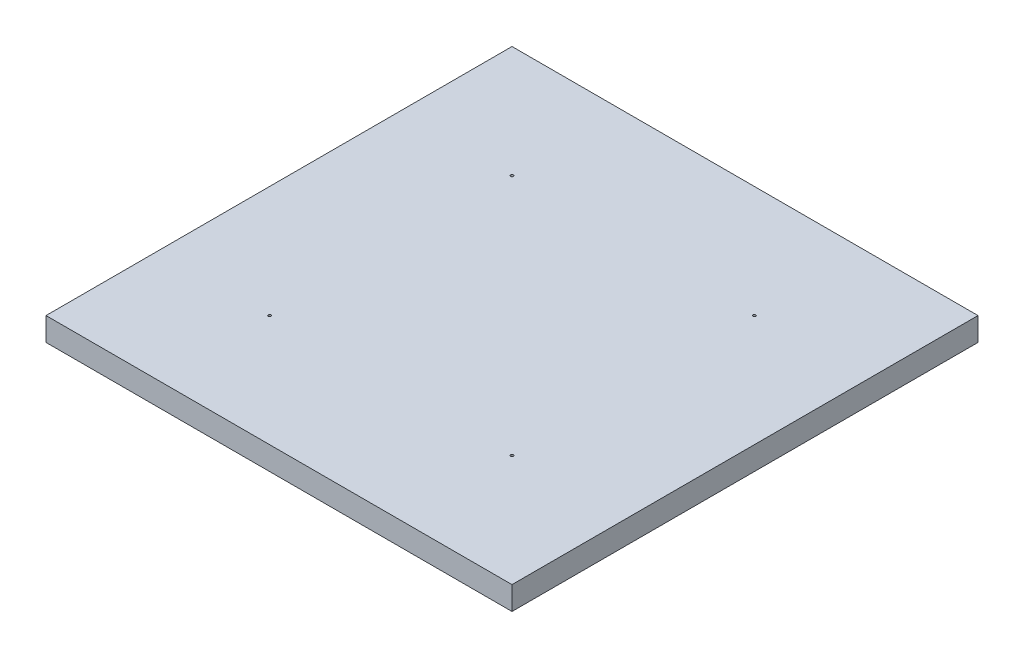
ISO-10303-21;
HEADER;
FILE_DESCRIPTION(('STEP AP214'),'2;1');
FILE_NAME('part.step','',(''),(''),'','','');
FILE_SCHEMA(('AUTOMOTIVE_DESIGN { 1 0 10303 214 1 1 1 1 }'));
ENDSEC;
DATA;
#1=APPLICATION_CONTEXT('core data for automotive mechanical design processes');
#2=APPLICATION_PROTOCOL_DEFINITION('international standard','automotive_design',2000,#1);
#3=PRODUCT_CONTEXT('',#1,'mechanical');
#4=PRODUCT('Part','Part','',(#3));
#5=PRODUCT_RELATED_PRODUCT_CATEGORY('part','',(#4));
#6=PRODUCT_DEFINITION_FORMATION('','',#4);
#7=PRODUCT_DEFINITION_CONTEXT('part definition',#1,'design');
#8=PRODUCT_DEFINITION('design','',#6,#7);
#9=PRODUCT_DEFINITION_SHAPE('','',#8);
#10=(LENGTH_UNIT() NAMED_UNIT(*) SI_UNIT(.MILLI.,.METRE.));
#11=(NAMED_UNIT(*) PLANE_ANGLE_UNIT() SI_UNIT($,.RADIAN.));
#12=(NAMED_UNIT(*) SI_UNIT($,.STERADIAN.) SOLID_ANGLE_UNIT());
#13=UNCERTAINTY_MEASURE_WITH_UNIT(LENGTH_MEASURE(1.E-05),#10,'distance_accuracy_value','');
#14=(GEOMETRIC_REPRESENTATION_CONTEXT(3) GLOBAL_UNCERTAINTY_ASSIGNED_CONTEXT((#13)) GLOBAL_UNIT_ASSIGNED_CONTEXT((#10,
#11,#12)) REPRESENTATION_CONTEXT('',''));
#15=CARTESIAN_POINT('',(0.,0.,0.));
#16=DIRECTION('',(0.,0.,1.));
#17=DIRECTION('',(1.,0.,0.));
#18=AXIS2_PLACEMENT_3D('',#15,#16,#17);
#19=CARTESIAN_POINT('',(-250.,25.,250.));
#20=DIRECTION('',(0.,-1.,0.));
#21=DIRECTION('',(0.,0.,-1.));
#22=AXIS2_PLACEMENT_3D('',#19,#20,#21);
#23=PLANE('',#22);
#24=CARTESIAN_POINT('',(-130.,25.,130.000000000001));
#25=DIRECTION('',(0.,-1.,0.));
#26=DIRECTION('',(-0.707106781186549,0.,0.707106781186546));
#27=AXIS2_PLACEMENT_3D('',#24,#25,#26);
#28=ELLIPSE('',#27,1.50763363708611,1.50000000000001);
#29=CARTESIAN_POINT('',(-131.066057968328,25.,131.066057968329));
#30=VERTEX_POINT('',#29);
#31=EDGE_CURVE('E429',#30,#30,#28,.F.);
#32=ORIENTED_EDGE('',*,*,#31,.F.);
#33=EDGE_LOOP('',(#32));
#34=FACE_BOUND('',#33,.T.);
#35=CARTESIAN_POINT('',(-130.,25.,-130.000000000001));
#36=DIRECTION('',(0.,-1.,0.));
#37=DIRECTION('',(-0.707106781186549,0.,-0.707106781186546));
#38=AXIS2_PLACEMENT_3D('',#35,#36,#37);
#39=ELLIPSE('',#38,1.50763363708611,1.50000000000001);
#40=CARTESIAN_POINT('',(-131.066057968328,25.,-131.066057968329));
#41=VERTEX_POINT('',#40);
#42=EDGE_CURVE('E408',#41,#41,#39,.T.);
#43=ORIENTED_EDGE('',*,*,#42,.T.);
#44=EDGE_LOOP('',(#43));
#45=FACE_BOUND('',#44,.T.);
#46=DIRECTION('',(0.,0.,1.));
#47=VECTOR('',#46,1.);
#48=CARTESIAN_POINT('',(-250.,25.,250.));
#49=LINE('',#48,#47);
#50=CARTESIAN_POINT('',(-250.,25.,-250.));
#51=VERTEX_POINT('',#50);
#52=CARTESIAN_POINT('',(-250.,25.,250.));
#53=VERTEX_POINT('',#52);
#54=EDGE_CURVE('E419',#51,#53,#49,.T.);
#55=ORIENTED_EDGE('',*,*,#54,.T.);
#56=DIRECTION('',(1.,0.,0.));
#57=VECTOR('',#56,1.);
#58=CARTESIAN_POINT('',(-250.,25.,250.));
#59=LINE('',#58,#57);
#60=CARTESIAN_POINT('',(250.,25.,250.));
#61=VERTEX_POINT('',#60);
#62=EDGE_CURVE('E403',#53,#61,#59,.T.);
#63=ORIENTED_EDGE('',*,*,#62,.T.);
#64=DIRECTION('',(0.,0.,-1.));
#65=VECTOR('',#64,1.);
#66=CARTESIAN_POINT('',(250.,25.,250.));
#67=LINE('',#66,#65);
#68=CARTESIAN_POINT('',(250.,25.,-250.));
#69=VERTEX_POINT('',#68);
#70=EDGE_CURVE('E370',#61,#69,#67,.T.);
#71=ORIENTED_EDGE('',*,*,#70,.T.);
#72=DIRECTION('',(-1.,0.,0.));
#73=VECTOR('',#72,1.);
#74=CARTESIAN_POINT('',(-250.,25.,-250.));
#75=LINE('',#74,#73);
#76=EDGE_CURVE('E365',#69,#51,#75,.T.);
#77=ORIENTED_EDGE('',*,*,#76,.T.);
#78=EDGE_LOOP('',(#55,#63,#71,#77));
#79=FACE_BOUND('',#78,.T.);
#80=CARTESIAN_POINT('',(130.,25.,130.000000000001));
#81=DIRECTION('',(0.,-1.,0.));
#82=DIRECTION('',(0.707106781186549,0.,0.707106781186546));
#83=AXIS2_PLACEMENT_3D('',#80,#81,#82);
#84=ELLIPSE('',#83,1.50763363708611,1.50000000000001);
#85=CARTESIAN_POINT('',(131.066057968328,25.,131.066057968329));
#86=VERTEX_POINT('',#85);
#87=EDGE_CURVE('E432',#86,#86,#84,.T.);
#88=ORIENTED_EDGE('',*,*,#87,.T.);
#89=EDGE_LOOP('',(#88));
#90=FACE_BOUND('',#89,.T.);
#91=CARTESIAN_POINT('',(130.,25.,-130.000000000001));
#92=DIRECTION('',(0.,-1.,0.));
#93=DIRECTION('',(0.707106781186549,0.,-0.707106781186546));
#94=AXIS2_PLACEMENT_3D('',#91,#92,#93);
#95=ELLIPSE('',#94,1.50763363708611,1.50000000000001);
#96=CARTESIAN_POINT('',(131.066057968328,25.,-131.066057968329));
#97=VERTEX_POINT('',#96);
#98=EDGE_CURVE('E352',#97,#97,#95,.F.);
#99=ORIENTED_EDGE('',*,*,#98,.F.);
#100=EDGE_LOOP('',(#99));
#101=FACE_BOUND('',#100,.T.);
#102=ADVANCED_FACE('F348',(#34,#45,#79,#90,#101),#23,.F.);
#103=CARTESIAN_POINT('',(-250.,25.,250.));
#104=DIRECTION('',(1.,0.,0.));
#105=DIRECTION('',(0.,0.,-1.));
#106=AXIS2_PLACEMENT_3D('',#103,#104,#105);
#107=PLANE('',#106);
#108=DIRECTION('',(0.,0.,1.));
#109=VECTOR('',#108,1.);
#110=CARTESIAN_POINT('',(-250.,0.,250.));
#111=LINE('',#110,#109);
#112=CARTESIAN_POINT('',(-250.,0.,-250.));
#113=VERTEX_POINT('',#112);
#114=CARTESIAN_POINT('',(-250.,0.,250.));
#115=VERTEX_POINT('',#114);
#116=EDGE_CURVE('E395',#113,#115,#111,.T.);
#117=ORIENTED_EDGE('',*,*,#116,.T.);
#118=DIRECTION('',(0.,-1.,0.));
#119=VECTOR('',#118,1.);
#120=CARTESIAN_POINT('',(-250.,25.,250.));
#121=LINE('',#120,#119);
#122=EDGE_CURVE('E11',#53,#115,#121,.T.);
#123=ORIENTED_EDGE('',*,*,#122,.F.);
#124=ORIENTED_EDGE('',*,*,#54,.F.);
#125=DIRECTION('',(0.,-1.,0.));
#126=VECTOR('',#125,1.);
#127=CARTESIAN_POINT('',(-250.,25.,-250.));
#128=LINE('',#127,#126);
#129=EDGE_CURVE('E407',#51,#113,#128,.T.);
#130=ORIENTED_EDGE('',*,*,#129,.T.);
#131=EDGE_LOOP('',(#117,#123,#124,#130));
#132=FACE_BOUND('',#131,.T.);
#133=ADVANCED_FACE('F350',(#132),#107,.F.);
#134=CARTESIAN_POINT('',(-250.,25.,250.));
#135=DIRECTION('',(0.,0.,-1.));
#136=DIRECTION('',(-1.,0.,0.));
#137=AXIS2_PLACEMENT_3D('',#134,#135,#136);
#138=PLANE('',#137);
#139=DIRECTION('',(1.,0.,0.));
#140=VECTOR('',#139,1.);
#141=CARTESIAN_POINT('',(-250.,0.,250.));
#142=LINE('',#141,#140);
#143=CARTESIAN_POINT('',(250.,0.,250.));
#144=VERTEX_POINT('',#143);
#145=EDGE_CURVE('E391',#115,#144,#142,.T.);
#146=ORIENTED_EDGE('',*,*,#145,.T.);
#147=DIRECTION('',(0.,-1.,0.));
#148=VECTOR('',#147,1.);
#149=CARTESIAN_POINT('',(250.,25.,250.));
#150=LINE('',#149,#148);
#151=EDGE_CURVE('E357',#61,#144,#150,.T.);
#152=ORIENTED_EDGE('',*,*,#151,.F.);
#153=ORIENTED_EDGE('',*,*,#62,.F.);
#154=ORIENTED_EDGE('',*,*,#122,.T.);
#155=EDGE_LOOP('',(#146,#152,#153,#154));
#156=FACE_BOUND('',#155,.T.);
#157=ADVANCED_FACE('F402',(#156),#138,.F.);
#158=CARTESIAN_POINT('',(250.,25.,250.));
#159=DIRECTION('',(-1.,0.,0.));
#160=DIRECTION('',(0.,0.,1.));
#161=AXIS2_PLACEMENT_3D('',#158,#159,#160);
#162=PLANE('',#161);
#163=DIRECTION('',(0.,0.,-1.));
#164=VECTOR('',#163,1.);
#165=CARTESIAN_POINT('',(250.,0.,250.));
#166=LINE('',#165,#164);
#167=CARTESIAN_POINT('',(250.,0.,-250.));
#168=VERTEX_POINT('',#167);
#169=EDGE_CURVE('E396',#144,#168,#166,.T.);
#170=ORIENTED_EDGE('',*,*,#169,.T.);
#171=DIRECTION('',(0.,-1.,0.));
#172=VECTOR('',#171,1.);
#173=CARTESIAN_POINT('',(250.,25.,-250.));
#174=LINE('',#173,#172);
#175=EDGE_CURVE('E425',#69,#168,#174,.T.);
#176=ORIENTED_EDGE('',*,*,#175,.F.);
#177=ORIENTED_EDGE('',*,*,#70,.F.);
#178=ORIENTED_EDGE('',*,*,#151,.T.);
#179=EDGE_LOOP('',(#170,#176,#177,#178));
#180=FACE_BOUND('',#179,.T.);
#181=ADVANCED_FACE('F475',(#180),#162,.F.);
#182=CARTESIAN_POINT('',(-250.,25.,-250.));
#183=DIRECTION('',(0.,0.,1.));
#184=DIRECTION('',(1.,0.,0.));
#185=AXIS2_PLACEMENT_3D('',#182,#183,#184);
#186=PLANE('',#185);
#187=DIRECTION('',(-1.,0.,0.));
#188=VECTOR('',#187,1.);
#189=CARTESIAN_POINT('',(-250.,0.,-250.));
#190=LINE('',#189,#188);
#191=EDGE_CURVE('E417',#168,#113,#190,.T.);
#192=ORIENTED_EDGE('',*,*,#191,.T.);
#193=ORIENTED_EDGE('',*,*,#129,.F.);
#194=ORIENTED_EDGE('',*,*,#76,.F.);
#195=ORIENTED_EDGE('',*,*,#175,.T.);
#196=EDGE_LOOP('',(#192,#193,#194,#195));
#197=FACE_BOUND('',#196,.T.);
#198=ADVANCED_FACE('F472',(#197),#186,.F.);
#199=CARTESIAN_POINT('',(-250.,0.,250.));
#200=DIRECTION('',(0.,-1.,0.));
#201=DIRECTION('',(0.,0.,-1.));
#202=AXIS2_PLACEMENT_3D('',#199,#200,#201);
#203=PLANE('',#202);
#204=ORIENTED_EDGE('',*,*,#116,.F.);
#205=ORIENTED_EDGE('',*,*,#191,.F.);
#206=ORIENTED_EDGE('',*,*,#169,.F.);
#207=ORIENTED_EDGE('',*,*,#145,.F.);
#208=EDGE_LOOP('',(#204,#205,#206,#207));
#209=FACE_BOUND('',#208,.T.);
#210=ADVANCED_FACE('F392',(#209),#203,.T.);
#211=CARTESIAN_POINT('',(-129.644665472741,20.0253166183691,-129.644665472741));
#212=DIRECTION('',(-0.0710669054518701,0.994936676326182,-0.0710669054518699));
#213=DIRECTION('',(-0.997458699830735,-0.0712470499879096,0.));
#214=AXIS2_PLACEMENT_3D('',#211,#212,#213);
#215=CYLINDRICAL_SURFACE('',#214,1.50000000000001);
#216=CARTESIAN_POINT('',(-129.644665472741,20.0253166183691,-129.644665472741));
#217=DIRECTION('',(-0.0710669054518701,0.994936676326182,-0.0710669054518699));
#218=DIRECTION('',(-0.997458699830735,-0.0712470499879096,0.));
#219=AXIS2_PLACEMENT_3D('',#216,#217,#218);
#220=CIRCLE('',#219,1.50000000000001);
#221=CARTESIAN_POINT('',(-131.140853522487,19.9184460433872,-129.644665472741));
#222=VERTEX_POINT('',#221);
#223=EDGE_CURVE('E411',#222,#222,#220,.T.);
#224=ORIENTED_EDGE('',*,*,#223,.F.);
#225=EDGE_LOOP('',(#224));
#226=FACE_BOUND('',#225,.T.);
#227=ORIENTED_EDGE('',*,*,#42,.F.);
#228=EDGE_LOOP('',(#227));
#229=FACE_BOUND('',#228,.T.);
#230=ADVANCED_FACE('F498',(#226,#229),#215,.F.);
#231=CARTESIAN_POINT('',(-129.644665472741,20.0253166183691,-129.644665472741));
#232=DIRECTION('',(-0.0710669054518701,0.994936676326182,-0.0710669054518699));
#233=DIRECTION('',(-0.997458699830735,-0.0712470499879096,0.));
#234=AXIS2_PLACEMENT_3D('',#231,#232,#233);
#235=PLANE('',#234);
#236=ORIENTED_EDGE('',*,*,#223,.T.);
#237=EDGE_LOOP('',(#236));
#238=FACE_BOUND('',#237,.T.);
#239=ADVANCED_FACE('F504',(#238),#235,.T.);
#240=CARTESIAN_POINT('',(-129.644665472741,20.0253166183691,129.644665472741));
#241=DIRECTION('',(-0.0710669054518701,0.994936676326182,0.0710669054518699));
#242=DIRECTION('',(-0.997458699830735,-0.0712470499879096,0.));
#243=AXIS2_PLACEMENT_3D('',#240,#241,#242);
#244=CYLINDRICAL_SURFACE('',#243,1.50000000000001);
#245=CARTESIAN_POINT('',(-129.644665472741,20.0253166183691,129.644665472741));
#246=DIRECTION('',(0.0710669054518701,-0.994936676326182,-0.0710669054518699));
#247=DIRECTION('',(-0.997458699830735,-0.0712470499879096,0.));
#248=AXIS2_PLACEMENT_3D('',#245,#246,#247);
#249=CIRCLE('',#248,1.50000000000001);
#250=CARTESIAN_POINT('',(-131.140853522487,19.9184460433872,129.644665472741));
#251=VERTEX_POINT('',#250);
#252=EDGE_CURVE('E431',#251,#251,#249,.T.);
#253=ORIENTED_EDGE('',*,*,#252,.T.);
#254=EDGE_LOOP('',(#253));
#255=FACE_BOUND('',#254,.T.);
#256=ORIENTED_EDGE('',*,*,#31,.T.);
#257=EDGE_LOOP('',(#256));
#258=FACE_BOUND('',#257,.T.);
#259=ADVANCED_FACE('F511',(#255,#258),#244,.F.);
#260=CARTESIAN_POINT('',(-129.644665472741,20.0253166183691,129.644665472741));
#261=DIRECTION('',(-0.0710669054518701,0.994936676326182,0.0710669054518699));
#262=DIRECTION('',(-0.997458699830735,-0.0712470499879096,0.));
#263=AXIS2_PLACEMENT_3D('',#260,#261,#262);
#264=PLANE('',#263);
#265=ORIENTED_EDGE('',*,*,#252,.F.);
#266=EDGE_LOOP('',(#265));
#267=FACE_BOUND('',#266,.T.);
#268=ADVANCED_FACE('F518',(#267),#264,.T.);
#269=CARTESIAN_POINT('',(129.644665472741,20.0253166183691,129.644665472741));
#270=DIRECTION('',(0.0710669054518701,0.994936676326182,0.0710669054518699));
#271=DIRECTION('',(-0.997458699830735,0.0712470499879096,0.));
#272=AXIS2_PLACEMENT_3D('',#269,#270,#271);
#273=CYLINDRICAL_SURFACE('',#272,1.50000000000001);
#274=CARTESIAN_POINT('',(129.644665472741,20.0253166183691,129.644665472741));
#275=DIRECTION('',(0.0710669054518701,0.994936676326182,0.0710669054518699));
#276=DIRECTION('',(0.997458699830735,-0.0712470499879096,0.));
#277=AXIS2_PLACEMENT_3D('',#274,#275,#276);
#278=CIRCLE('',#277,1.50000000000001);
#279=CARTESIAN_POINT('',(131.140853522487,19.9184460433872,129.644665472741));
#280=VERTEX_POINT('',#279);
#281=EDGE_CURVE('E434',#280,#280,#278,.T.);
#282=ORIENTED_EDGE('',*,*,#281,.F.);
#283=EDGE_LOOP('',(#282));
#284=FACE_BOUND('',#283,.T.);
#285=ORIENTED_EDGE('',*,*,#87,.F.);
#286=EDGE_LOOP('',(#285));
#287=FACE_BOUND('',#286,.T.);
#288=ADVANCED_FACE('F525',(#284,#287),#273,.F.);
#289=CARTESIAN_POINT('',(129.644665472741,20.0253166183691,129.644665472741));
#290=DIRECTION('',(0.0710669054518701,0.994936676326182,0.0710669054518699));
#291=DIRECTION('',(0.997458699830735,-0.0712470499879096,0.));
#292=AXIS2_PLACEMENT_3D('',#289,#290,#291);
#293=PLANE('',#292);
#294=ORIENTED_EDGE('',*,*,#281,.T.);
#295=EDGE_LOOP('',(#294));
#296=FACE_BOUND('',#295,.T.);
#297=ADVANCED_FACE('F457',(#296),#293,.T.);
#298=CARTESIAN_POINT('',(129.644665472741,20.0253166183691,-129.644665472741));
#299=DIRECTION('',(0.0710669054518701,0.994936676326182,-0.0710669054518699));
#300=DIRECTION('',(-0.997458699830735,0.0712470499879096,0.));
#301=AXIS2_PLACEMENT_3D('',#298,#299,#300);
#302=CYLINDRICAL_SURFACE('',#301,1.50000000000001);
#303=CARTESIAN_POINT('',(129.644665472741,20.0253166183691,-129.644665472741));
#304=DIRECTION('',(-0.0710669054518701,-0.994936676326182,0.0710669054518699));
#305=DIRECTION('',(0.997458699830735,-0.0712470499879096,0.));
#306=AXIS2_PLACEMENT_3D('',#303,#304,#305);
#307=CIRCLE('',#306,1.50000000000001);
#308=CARTESIAN_POINT('',(131.140853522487,19.9184460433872,-129.644665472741));
#309=VERTEX_POINT('',#308);
#310=EDGE_CURVE('E443',#309,#309,#307,.T.);
#311=ORIENTED_EDGE('',*,*,#310,.T.);
#312=EDGE_LOOP('',(#311));
#313=FACE_BOUND('',#312,.T.);
#314=ORIENTED_EDGE('',*,*,#98,.T.);
#315=EDGE_LOOP('',(#314));
#316=FACE_BOUND('',#315,.T.);
#317=ADVANCED_FACE('F448',(#313,#316),#302,.F.);
#318=CARTESIAN_POINT('',(129.644665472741,20.0253166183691,-129.644665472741));
#319=DIRECTION('',(0.0710669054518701,0.994936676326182,-0.0710669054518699));
#320=DIRECTION('',(0.997458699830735,-0.0712470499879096,0.));
#321=AXIS2_PLACEMENT_3D('',#318,#319,#320);
#322=PLANE('',#321);
#323=ORIENTED_EDGE('',*,*,#310,.F.);
#324=EDGE_LOOP('',(#323));
#325=FACE_BOUND('',#324,.T.);
#326=ADVANCED_FACE('F451',(#325),#322,.T.);
#327=CLOSED_SHELL('',(#102,#133,#157,#181,#198,#210,#230,#239,#259,#268,#288,#297,#317,#326));
#328=MANIFOLD_SOLID_BREP('B2',#327);
#329=ADVANCED_BREP_SHAPE_REPRESENTATION('',(#18,#328),#14);
#330=SHAPE_DEFINITION_REPRESENTATION(#9,#329);
ENDSEC;
END-ISO-10303-21;
